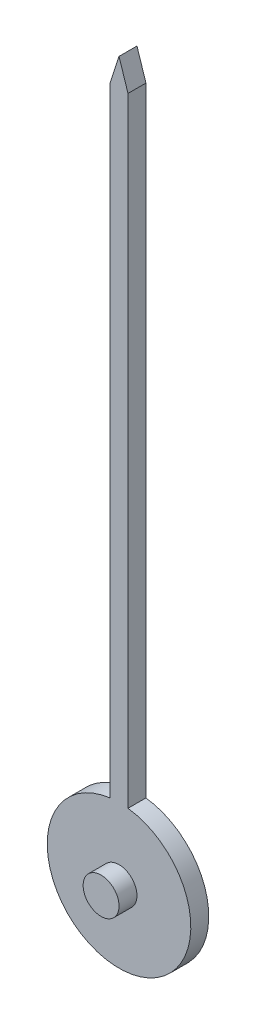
from build123d import *

# Parameters (mm, degrees)
BOSS_EXTRU_1_DEPTH = 1
ESQUISSE2_R        = 1
BOSS_EXTRU_2_DEPTH = 1


with BuildPart() as part:
    # Esquisse1 → Boss.-Extru.1 (new body)
    with BuildSketch(Plane.XY):
        with BuildLine():
            Line((0, 40), (-0.5, 38.461250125))
            Line((-0.5, 38.461250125), (-0.5, 3.968626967))
            ThreePointArc((-0.5, 3.968626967), (0, -4), (0.5, 3.968626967))
            Line((0.5, 3.968626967), (0.5, 38.461250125))
            Line((0.5, 38.461250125), (0, 40))
        make_face()
    extrude(amount=BOSS_EXTRU_1_DEPTH)

    # Esquisse2 → Boss.-Extru.2 (add)
    with BuildSketch(Plane.XY.offset(1)):
        Circle(ESQUISSE2_R)
    extrude(amount=BOSS_EXTRU_2_DEPTH)


solid = part.part
